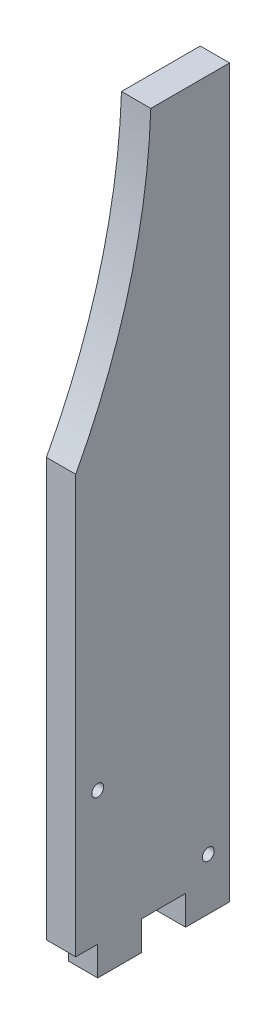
from build123d import *

# Parameters (mm, degrees)
SKETCH1_R           = 4.05
BOSS_EXTRUDE1_DEPTH = 20


with BuildPart() as part:
    # Sketch1 → Boss-Extrude1 (new body)
    with BuildSketch(Plane(origin=(0, 0, 0), x_dir=(0, 0, -1), z_dir=(1, 0, 0))):
        with BuildLine():
            Line((0, 0), (15, 0))
            Line((15, 0), (15, -20))
            Line((15, -20), (45, -20))
            Line((45, -20), (45, 0))
            Line((45, 0), (75, 0))
            Line((75, 0), (75, -20))
            Line((75, -20), (105, -20))
            Line((105, -20), (105, 0))
            Line((105, 0), (105, 475.917508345))
            Line((105, 475.917508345), (51.232696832, 475.917508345))
            ThreePointArc((51.232696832, 475.917508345), (36.537985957, 377.649277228), (0, 285.250384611))
            Line((0, 285.250384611), (0, 0))
        make_face()
        with Locations((15, 90.917508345)):
            Circle(SKETCH1_R, mode=Mode.SUBTRACT)
        with Locations((90.496317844, 15.421190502)):
            Circle(SKETCH1_R, mode=Mode.SUBTRACT)
    extrude(amount=BOSS_EXTRUDE1_DEPTH)


solid = part.part
